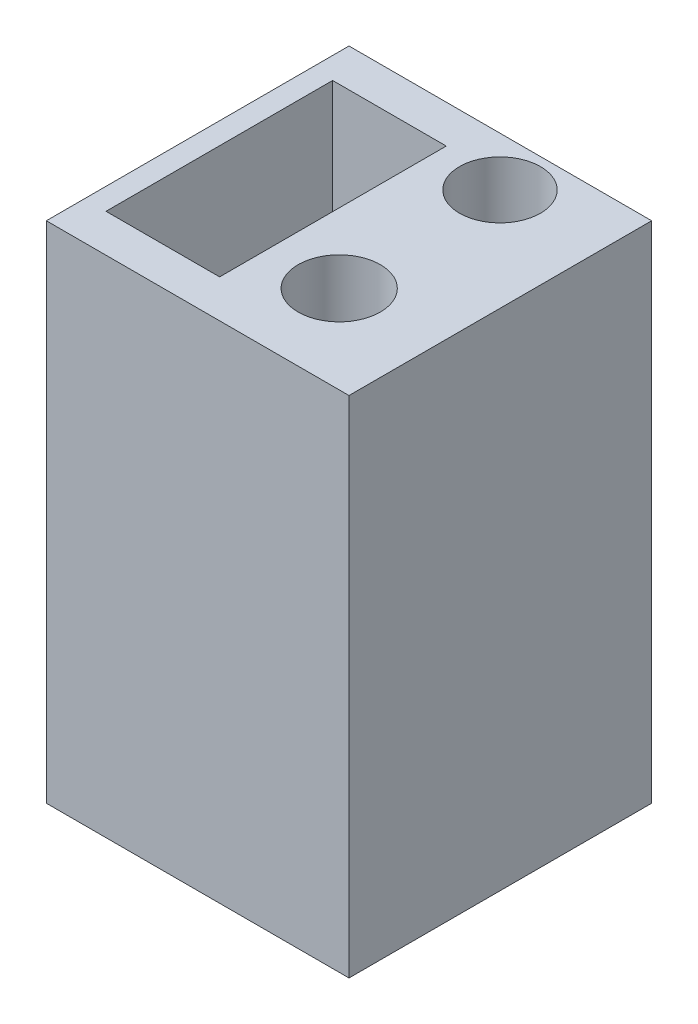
from build123d import *

# Parameters (mm, degrees)
SKETCH1_W           = 30
SKETCH1_H           = 30
BOSS_EXTRUDE1_DEPTH = 50
SKETCH2_R           = 4.010387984
SKETCH2_R_2         = 4.07450798
SKETCH2_W           = 11.262213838
SKETCH2_H           = 22.463219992
CUT_EXTRUDE1_DEPTH  = 44.412


with BuildPart() as part:
    # Sketch1 → Boss-Extrude1 (new body)
    with BuildSketch(Plane(origin=(0, 0, 0), x_dir=(1, 0, 0), z_dir=(0, 1, 0))):
        Rectangle(SKETCH1_W, SKETCH1_H)
    extrude(amount=BOSS_EXTRUDE1_DEPTH)

    # Sketch2 → Cut-Extrude1 (cut)
    with BuildSketch(Plane(origin=(0, 50, 0), x_dir=(1, 0, 0), z_dir=(0, 1, 0))):
        with Locations(Location((4.835407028, 10.129871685, 0), (0, 0, 270))):
            Circle(SKETCH2_R)
        with Locations(Location((5.318219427, -6.287448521, 0), (0, 0, 270))):
            Circle(SKETCH2_R_2)
        with Locations((-7.2225067, 0)):
            Rectangle(SKETCH2_W, SKETCH2_H)
    extrude(amount=-CUT_EXTRUDE1_DEPTH, mode=Mode.SUBTRACT)


solid = part.part
